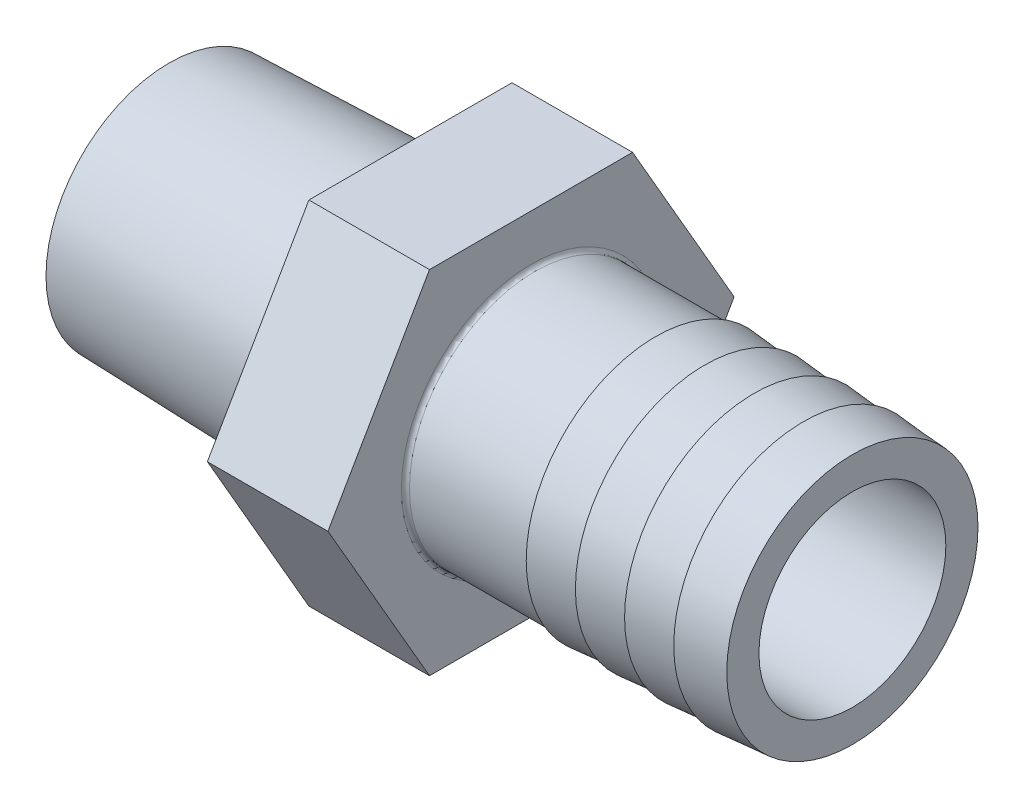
ISO-10303-21;
HEADER;
FILE_DESCRIPTION(('STEP AP214'),'2;1');
FILE_NAME('part.step','',(''),(''),'','','');
FILE_SCHEMA(('AUTOMOTIVE_DESIGN { 1 0 10303 214 1 1 1 1 }'));
ENDSEC;
DATA;
#1=APPLICATION_CONTEXT('core data for automotive mechanical design processes');
#2=APPLICATION_PROTOCOL_DEFINITION('international standard','automotive_design',2000,#1);
#3=PRODUCT_CONTEXT('',#1,'mechanical');
#4=PRODUCT('Part','Part','',(#3));
#5=PRODUCT_RELATED_PRODUCT_CATEGORY('part','',(#4));
#6=PRODUCT_DEFINITION_FORMATION('','',#4);
#7=PRODUCT_DEFINITION_CONTEXT('part definition',#1,'design');
#8=PRODUCT_DEFINITION('design','',#6,#7);
#9=PRODUCT_DEFINITION_SHAPE('','',#8);
#10=(LENGTH_UNIT() NAMED_UNIT(*) SI_UNIT(.MILLI.,.METRE.));
#11=(NAMED_UNIT(*) PLANE_ANGLE_UNIT() SI_UNIT($,.RADIAN.));
#12=(NAMED_UNIT(*) SI_UNIT($,.STERADIAN.) SOLID_ANGLE_UNIT());
#13=UNCERTAINTY_MEASURE_WITH_UNIT(LENGTH_MEASURE(1.E-05),#10,'distance_accuracy_value','');
#14=(GEOMETRIC_REPRESENTATION_CONTEXT(3) GLOBAL_UNCERTAINTY_ASSIGNED_CONTEXT((#13)) GLOBAL_UNIT_ASSIGNED_CONTEXT((#10,
#11,#12)) REPRESENTATION_CONTEXT('',''));
#15=CARTESIAN_POINT('',(0.,0.,0.));
#16=DIRECTION('',(0.,0.,1.));
#17=DIRECTION('',(1.,0.,0.));
#18=AXIS2_PLACEMENT_3D('',#15,#16,#17);
#19=CARTESIAN_POINT('',(-50.7999999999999,0.,0.));
#20=DIRECTION('',(-1.,0.,0.));
#21=DIRECTION('',(0.,0.,1.));
#22=AXIS2_PLACEMENT_3D('',#19,#20,#21);
#23=CYLINDRICAL_SURFACE('',#22,5.9055);
#24=CARTESIAN_POINT('',(27.92476,0.,0.));
#25=DIRECTION('',(-1.,0.,0.));
#26=DIRECTION('',(0.,0.,1.));
#27=AXIS2_PLACEMENT_3D('',#24,#25,#26);
#28=CIRCLE('',#27,5.9055);
#29=CARTESIAN_POINT('',(27.92476,0.,5.9055));
#30=VERTEX_POINT('',#29);
#31=EDGE_CURVE('E144',#30,#30,#28,.T.);
#32=ORIENTED_EDGE('',*,*,#31,.F.);
#33=EDGE_LOOP('',(#32));
#34=FACE_BOUND('',#33,.T.);
#35=CARTESIAN_POINT('',(7.62,0.,0.));
#36=DIRECTION('',(-1.,0.,0.));
#37=DIRECTION('',(0.,0.,1.));
#38=AXIS2_PLACEMENT_3D('',#35,#36,#37);
#39=CIRCLE('',#38,5.9055);
#40=CARTESIAN_POINT('',(7.62,0.,5.9055));
#41=VERTEX_POINT('',#40);
#42=EDGE_CURVE('E11',#41,#41,#39,.F.);
#43=ORIENTED_EDGE('',*,*,#42,.F.);
#44=EDGE_LOOP('',(#43));
#45=FACE_BOUND('',#44,.T.);
#46=ADVANCED_FACE('F35',(#34,#45),#23,.F.);
#47=CARTESIAN_POINT('',(7.62,8.24930684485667,0.));
#48=DIRECTION('',(-1.,0.,0.));
#49=DIRECTION('',(0.,0.,1.));
#50=AXIS2_PLACEMENT_3D('',#47,#48,#49);
#51=PLANE('',#50);
#52=CARTESIAN_POINT('',(7.62,0.,0.));
#53=DIRECTION('',(-1.,0.,0.));
#54=DIRECTION('',(0.,0.,1.));
#55=AXIS2_PLACEMENT_3D('',#52,#53,#54);
#56=CIRCLE('',#55,8.1915);
#57=CARTESIAN_POINT('',(7.62,0.,8.1915));
#58=VERTEX_POINT('',#57);
#59=EDGE_CURVE('E138',#58,#58,#56,.T.);
#60=ORIENTED_EDGE('',*,*,#59,.T.);
#61=EDGE_LOOP('',(#60));
#62=FACE_BOUND('',#61,.T.);
#63=DIRECTION('',(0.,0.866025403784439,-0.5));
#64=VECTOR('',#63,1.);
#65=CARTESIAN_POINT('',(7.62,-11.1125,-6.41580486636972));
#66=LINE('',#65,#64);
#67=CARTESIAN_POINT('',(7.62,-11.1125,-6.41580486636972));
#68=VERTEX_POINT('',#67);
#69=CARTESIAN_POINT('',(7.62,0.,-12.8316097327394));
#70=VERTEX_POINT('',#69);
#71=EDGE_CURVE('E89',#68,#70,#66,.T.);
#72=ORIENTED_EDGE('',*,*,#71,.T.);
#73=DIRECTION('',(0.,0.866025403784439,0.5));
#74=VECTOR('',#73,1.);
#75=CARTESIAN_POINT('',(7.62,0.,-12.8316097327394));
#76=LINE('',#75,#74);
#77=CARTESIAN_POINT('',(7.62,11.1125,-6.41580486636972));
#78=VERTEX_POINT('',#77);
#79=EDGE_CURVE('E99',#70,#78,#76,.T.);
#80=ORIENTED_EDGE('',*,*,#79,.T.);
#81=DIRECTION('',(0.,0.,1.));
#82=VECTOR('',#81,1.);
#83=CARTESIAN_POINT('',(7.62,11.1125,-6.41580486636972));
#84=LINE('',#83,#82);
#85=CARTESIAN_POINT('',(7.62,11.1125,6.41580486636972));
#86=VERTEX_POINT('',#85);
#87=EDGE_CURVE('E105',#78,#86,#84,.T.);
#88=ORIENTED_EDGE('',*,*,#87,.T.);
#89=DIRECTION('',(0.,-0.866025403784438,0.5));
#90=VECTOR('',#89,1.);
#91=CARTESIAN_POINT('',(7.62,11.1125,6.41580486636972));
#92=LINE('',#91,#90);
#93=CARTESIAN_POINT('',(7.62,0.,12.8316097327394));
#94=VERTEX_POINT('',#93);
#95=EDGE_CURVE('E114',#86,#94,#92,.T.);
#96=ORIENTED_EDGE('',*,*,#95,.T.);
#97=DIRECTION('',(0.,-0.866025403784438,-0.5));
#98=VECTOR('',#97,1.);
#99=CARTESIAN_POINT('',(7.62,0.,12.8316097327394));
#100=LINE('',#99,#98);
#101=CARTESIAN_POINT('',(7.62,-11.1125,6.41580486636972));
#102=VERTEX_POINT('',#101);
#103=EDGE_CURVE('E117',#94,#102,#100,.T.);
#104=ORIENTED_EDGE('',*,*,#103,.T.);
#105=DIRECTION('',(0.,0.,-1.));
#106=VECTOR('',#105,1.);
#107=CARTESIAN_POINT('',(7.62,-11.1125,6.41580486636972));
#108=LINE('',#107,#106);
#109=EDGE_CURVE('E96',#102,#68,#108,.T.);
#110=ORIENTED_EDGE('',*,*,#109,.T.);
#111=EDGE_LOOP('',(#72,#80,#88,#96,#104,#110));
#112=FACE_BOUND('',#111,.T.);
#113=ADVANCED_FACE('F37',(#62,#112),#51,.F.);
#114=CARTESIAN_POINT('',(7.874,0.,0.));
#115=DIRECTION('',(-1.,0.,0.));
#116=DIRECTION('',(0.,0.,1.));
#117=AXIS2_PLACEMENT_3D('',#114,#115,#116);
#118=TOROIDAL_SURFACE('',#117,8.1915,0.253999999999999);
#119=ORIENTED_EDGE('',*,*,#59,.F.);
#120=EDGE_LOOP('',(#119));
#121=FACE_BOUND('',#120,.T.);
#122=CARTESIAN_POINT('',(7.874,0.,0.));
#123=DIRECTION('',(-1.,0.,0.));
#124=DIRECTION('',(0.,0.,1.));
#125=AXIS2_PLACEMENT_3D('',#122,#123,#124);
#126=CIRCLE('',#125,7.9375);
#127=CARTESIAN_POINT('',(7.874,0.,7.9375));
#128=VERTEX_POINT('',#127);
#129=EDGE_CURVE('E174',#128,#128,#126,.T.);
#130=ORIENTED_EDGE('',*,*,#129,.T.);
#131=EDGE_LOOP('',(#130));
#132=FACE_BOUND('',#131,.T.);
#133=ADVANCED_FACE('F180',(#121,#132),#118,.F.);
#134=CARTESIAN_POINT('',(-50.7999999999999,0.,0.));
#135=DIRECTION('',(-1.,0.,0.));
#136=DIRECTION('',(0.,0.,1.));
#137=AXIS2_PLACEMENT_3D('',#134,#135,#136);
#138=CYLINDRICAL_SURFACE('',#137,7.9375);
#139=ORIENTED_EDGE('',*,*,#129,.F.);
#140=EDGE_LOOP('',(#139));
#141=FACE_BOUND('',#140,.T.);
#142=CARTESIAN_POINT('',(15.494,0.,0.));
#143=DIRECTION('',(-1.,0.,0.));
#144=DIRECTION('',(0.,0.,1.));
#145=AXIS2_PLACEMENT_3D('',#142,#143,#144);
#146=CIRCLE('',#145,7.9375);
#147=CARTESIAN_POINT('',(15.494,0.,7.9375));
#148=VERTEX_POINT('',#147);
#149=EDGE_CURVE('E171',#148,#148,#146,.T.);
#150=ORIENTED_EDGE('',*,*,#149,.T.);
#151=EDGE_LOOP('',(#150));
#152=FACE_BOUND('',#151,.T.);
#153=ADVANCED_FACE('F183',(#141,#152),#138,.T.);
#154=CARTESIAN_POINT('',(15.494,7.9375,0.));
#155=DIRECTION('',(1.,0.,0.));
#156=DIRECTION('',(0.,0.,-1.));
#157=AXIS2_PLACEMENT_3D('',#154,#155,#156);
#158=PLANE('',#157);
#159=ORIENTED_EDGE('',*,*,#149,.F.);
#160=EDGE_LOOP('',(#159));
#161=FACE_BOUND('',#160,.T.);
#162=CARTESIAN_POINT('',(15.494,0.,0.));
#163=DIRECTION('',(-1.,0.,0.));
#164=DIRECTION('',(0.,0.,1.));
#165=AXIS2_PLACEMENT_3D('',#162,#163,#164);
#166=CIRCLE('',#165,8.1788);
#167=CARTESIAN_POINT('',(15.494,0.,8.1788));
#168=VERTEX_POINT('',#167);
#169=EDGE_CURVE('E168',#168,#168,#166,.T.);
#170=ORIENTED_EDGE('',*,*,#169,.T.);
#171=EDGE_LOOP('',(#170));
#172=FACE_BOUND('',#171,.T.);
#173=ADVANCED_FACE('F188',(#161,#172),#158,.F.);
#174=CARTESIAN_POINT('',(18.60169,0.,0.));
#175=DIRECTION('',(-1.,0.,0.));
#176=DIRECTION('',(0.,0.,1.));
#177=AXIS2_PLACEMENT_3D('',#174,#175,#176);
#178=CONICAL_SURFACE('',#177,7.9375,0.0774906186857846);
#179=ORIENTED_EDGE('',*,*,#169,.F.);
#180=EDGE_LOOP('',(#179));
#181=FACE_BOUND('',#180,.T.);
#182=CARTESIAN_POINT('',(18.60169,0.,0.));
#183=DIRECTION('',(-1.,0.,0.));
#184=DIRECTION('',(0.,0.,1.));
#185=AXIS2_PLACEMENT_3D('',#182,#183,#184);
#186=CIRCLE('',#185,7.9375);
#187=CARTESIAN_POINT('',(18.60169,0.,7.9375));
#188=VERTEX_POINT('',#187);
#189=EDGE_CURVE('E165',#188,#188,#186,.T.);
#190=ORIENTED_EDGE('',*,*,#189,.T.);
#191=EDGE_LOOP('',(#190));
#192=FACE_BOUND('',#191,.T.);
#193=ADVANCED_FACE('F194',(#181,#192),#178,.T.);
#194=CARTESIAN_POINT('',(18.60169,7.9375,0.));
#195=DIRECTION('',(1.,0.,0.));
#196=DIRECTION('',(0.,0.,-1.));
#197=AXIS2_PLACEMENT_3D('',#194,#195,#196);
#198=PLANE('',#197);
#199=ORIENTED_EDGE('',*,*,#189,.F.);
#200=EDGE_LOOP('',(#199));
#201=FACE_BOUND('',#200,.T.);
#202=CARTESIAN_POINT('',(18.60169,0.,0.));
#203=DIRECTION('',(-1.,0.,0.));
#204=DIRECTION('',(0.,0.,1.));
#205=AXIS2_PLACEMENT_3D('',#202,#203,#204);
#206=CIRCLE('',#205,8.1788);
#207=CARTESIAN_POINT('',(18.60169,0.,8.1788));
#208=VERTEX_POINT('',#207);
#209=EDGE_CURVE('E162',#208,#208,#206,.T.);
#210=ORIENTED_EDGE('',*,*,#209,.T.);
#211=EDGE_LOOP('',(#210));
#212=FACE_BOUND('',#211,.T.);
#213=ADVANCED_FACE('F200',(#201,#212),#198,.F.);
#214=CARTESIAN_POINT('',(21.70938,0.,0.));
#215=DIRECTION('',(-1.,0.,0.));
#216=DIRECTION('',(0.,0.,1.));
#217=AXIS2_PLACEMENT_3D('',#214,#215,#216);
#218=CONICAL_SURFACE('',#217,7.9375,0.0774906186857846);
#219=ORIENTED_EDGE('',*,*,#209,.F.);
#220=EDGE_LOOP('',(#219));
#221=FACE_BOUND('',#220,.T.);
#222=CARTESIAN_POINT('',(21.70938,0.,0.));
#223=DIRECTION('',(-1.,0.,0.));
#224=DIRECTION('',(0.,0.,1.));
#225=AXIS2_PLACEMENT_3D('',#222,#223,#224);
#226=CIRCLE('',#225,7.9375);
#227=CARTESIAN_POINT('',(21.70938,0.,7.9375));
#228=VERTEX_POINT('',#227);
#229=EDGE_CURVE('E159',#228,#228,#226,.T.);
#230=ORIENTED_EDGE('',*,*,#229,.T.);
#231=EDGE_LOOP('',(#230));
#232=FACE_BOUND('',#231,.T.);
#233=ADVANCED_FACE('F206',(#221,#232),#218,.T.);
#234=CARTESIAN_POINT('',(21.70938,7.9375,0.));
#235=DIRECTION('',(1.,0.,0.));
#236=DIRECTION('',(0.,0.,-1.));
#237=AXIS2_PLACEMENT_3D('',#234,#235,#236);
#238=PLANE('',#237);
#239=ORIENTED_EDGE('',*,*,#229,.F.);
#240=EDGE_LOOP('',(#239));
#241=FACE_BOUND('',#240,.T.);
#242=CARTESIAN_POINT('',(21.70938,0.,0.));
#243=DIRECTION('',(-1.,0.,0.));
#244=DIRECTION('',(0.,0.,1.));
#245=AXIS2_PLACEMENT_3D('',#242,#243,#244);
#246=CIRCLE('',#245,8.1788);
#247=CARTESIAN_POINT('',(21.70938,0.,8.1788));
#248=VERTEX_POINT('',#247);
#249=EDGE_CURVE('E156',#248,#248,#246,.T.);
#250=ORIENTED_EDGE('',*,*,#249,.T.);
#251=EDGE_LOOP('',(#250));
#252=FACE_BOUND('',#251,.T.);
#253=ADVANCED_FACE('F212',(#241,#252),#238,.F.);
#254=CARTESIAN_POINT('',(24.81707,0.,0.));
#255=DIRECTION('',(-1.,0.,0.));
#256=DIRECTION('',(0.,0.,1.));
#257=AXIS2_PLACEMENT_3D('',#254,#255,#256);
#258=CONICAL_SURFACE('',#257,7.9375,0.077490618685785);
#259=ORIENTED_EDGE('',*,*,#249,.F.);
#260=EDGE_LOOP('',(#259));
#261=FACE_BOUND('',#260,.T.);
#262=CARTESIAN_POINT('',(24.81707,0.,0.));
#263=DIRECTION('',(-1.,0.,0.));
#264=DIRECTION('',(0.,0.,1.));
#265=AXIS2_PLACEMENT_3D('',#262,#263,#264);
#266=CIRCLE('',#265,7.9375);
#267=CARTESIAN_POINT('',(24.81707,0.,7.9375));
#268=VERTEX_POINT('',#267);
#269=EDGE_CURVE('E153',#268,#268,#266,.T.);
#270=ORIENTED_EDGE('',*,*,#269,.T.);
#271=EDGE_LOOP('',(#270));
#272=FACE_BOUND('',#271,.T.);
#273=ADVANCED_FACE('F218',(#261,#272),#258,.T.);
#274=CARTESIAN_POINT('',(24.81707,7.9375,0.));
#275=DIRECTION('',(1.,0.,0.));
#276=DIRECTION('',(0.,0.,-1.));
#277=AXIS2_PLACEMENT_3D('',#274,#275,#276);
#278=PLANE('',#277);
#279=ORIENTED_EDGE('',*,*,#269,.F.);
#280=EDGE_LOOP('',(#279));
#281=FACE_BOUND('',#280,.T.);
#282=CARTESIAN_POINT('',(24.81707,0.,0.));
#283=DIRECTION('',(-1.,0.,0.));
#284=DIRECTION('',(0.,0.,1.));
#285=AXIS2_PLACEMENT_3D('',#282,#283,#284);
#286=CIRCLE('',#285,8.1788);
#287=CARTESIAN_POINT('',(24.81707,0.,8.1788));
#288=VERTEX_POINT('',#287);
#289=EDGE_CURVE('E150',#288,#288,#286,.T.);
#290=ORIENTED_EDGE('',*,*,#289,.T.);
#291=EDGE_LOOP('',(#290));
#292=FACE_BOUND('',#291,.T.);
#293=ADVANCED_FACE('F224',(#281,#292),#278,.F.);
#294=CARTESIAN_POINT('',(27.92476,0.,0.));
#295=DIRECTION('',(-1.,0.,0.));
#296=DIRECTION('',(0.,0.,1.));
#297=AXIS2_PLACEMENT_3D('',#294,#295,#296);
#298=CONICAL_SURFACE('',#297,7.9375,0.077490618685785);
#299=ORIENTED_EDGE('',*,*,#289,.F.);
#300=EDGE_LOOP('',(#299));
#301=FACE_BOUND('',#300,.T.);
#302=CARTESIAN_POINT('',(27.92476,0.,0.));
#303=DIRECTION('',(-1.,0.,0.));
#304=DIRECTION('',(0.,0.,1.));
#305=AXIS2_PLACEMENT_3D('',#302,#303,#304);
#306=CIRCLE('',#305,7.9375);
#307=CARTESIAN_POINT('',(27.92476,0.,7.9375));
#308=VERTEX_POINT('',#307);
#309=EDGE_CURVE('E147',#308,#308,#306,.T.);
#310=ORIENTED_EDGE('',*,*,#309,.T.);
#311=EDGE_LOOP('',(#310));
#312=FACE_BOUND('',#311,.T.);
#313=ADVANCED_FACE('F230',(#301,#312),#298,.T.);
#314=CARTESIAN_POINT('',(27.92476,5.9055,0.));
#315=DIRECTION('',(-1.,0.,0.));
#316=DIRECTION('',(0.,0.,1.));
#317=AXIS2_PLACEMENT_3D('',#314,#315,#316);
#318=PLANE('',#317);
#319=ORIENTED_EDGE('',*,*,#309,.F.);
#320=EDGE_LOOP('',(#319));
#321=FACE_BOUND('',#320,.T.);
#322=ORIENTED_EDGE('',*,*,#31,.T.);
#323=EDGE_LOOP('',(#322));
#324=FACE_BOUND('',#323,.T.);
#325=ADVANCED_FACE('F236',(#321,#324),#318,.F.);
#326=CARTESIAN_POINT('',(0.,0.,0.));
#327=DIRECTION('',(1.,0.,0.));
#328=DIRECTION('',(0.,0.,-1.));
#329=AXIS2_PLACEMENT_3D('',#326,#327,#328);
#330=PLANE('',#329);
#331=CARTESIAN_POINT('',(0.,0.,0.));
#332=DIRECTION('',(1.,0.,0.));
#333=DIRECTION('',(0.,0.,-1.));
#334=AXIS2_PLACEMENT_3D('',#331,#332,#333);
#335=CIRCLE('',#334,8.24930684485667);
#336=CARTESIAN_POINT('',(0.,0.,-8.24930684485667));
#337=VERTEX_POINT('',#336);
#338=EDGE_CURVE('E132',#337,#337,#335,.T.);
#339=ORIENTED_EDGE('',*,*,#338,.T.);
#340=EDGE_LOOP('',(#339));
#341=FACE_BOUND('',#340,.T.);
#342=DIRECTION('',(0.,-0.866025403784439,0.5));
#343=VECTOR('',#342,1.);
#344=CARTESIAN_POINT('',(0.,-11.1125,-6.41580486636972));
#345=LINE('',#344,#343);
#346=CARTESIAN_POINT('',(0.,0.,-12.8316097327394));
#347=VERTEX_POINT('',#346);
#348=CARTESIAN_POINT('',(0.,-11.1125,-6.41580486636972));
#349=VERTEX_POINT('',#348);
#350=EDGE_CURVE('E92',#347,#349,#345,.T.);
#351=ORIENTED_EDGE('',*,*,#350,.T.);
#352=DIRECTION('',(0.,0.,1.));
#353=VECTOR('',#352,1.);
#354=CARTESIAN_POINT('',(0.,-11.1125,6.41580486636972));
#355=LINE('',#354,#353);
#356=CARTESIAN_POINT('',(0.,-11.1125,6.41580486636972));
#357=VERTEX_POINT('',#356);
#358=EDGE_CURVE('E299',#349,#357,#355,.T.);
#359=ORIENTED_EDGE('',*,*,#358,.T.);
#360=DIRECTION('',(0.,0.866025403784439,0.5));
#361=VECTOR('',#360,1.);
#362=CARTESIAN_POINT('',(0.,0.,12.8316097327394));
#363=LINE('',#362,#361);
#364=CARTESIAN_POINT('',(0.,0.,12.8316097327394));
#365=VERTEX_POINT('',#364);
#366=EDGE_CURVE('E302',#357,#365,#363,.T.);
#367=ORIENTED_EDGE('',*,*,#366,.T.);
#368=DIRECTION('',(0.,0.866025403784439,-0.5));
#369=VECTOR('',#368,1.);
#370=CARTESIAN_POINT('',(0.,11.1125,6.41580486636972));
#371=LINE('',#370,#369);
#372=CARTESIAN_POINT('',(0.,11.1125,6.41580486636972));
#373=VERTEX_POINT('',#372);
#374=EDGE_CURVE('E51',#365,#373,#371,.T.);
#375=ORIENTED_EDGE('',*,*,#374,.T.);
#376=DIRECTION('',(0.,0.,-1.));
#377=VECTOR('',#376,1.);
#378=CARTESIAN_POINT('',(0.,11.1125,-6.41580486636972));
#379=LINE('',#378,#377);
#380=CARTESIAN_POINT('',(0.,11.1125,-6.41580486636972));
#381=VERTEX_POINT('',#380);
#382=EDGE_CURVE('E122',#373,#381,#379,.T.);
#383=ORIENTED_EDGE('',*,*,#382,.T.);
#384=DIRECTION('',(0.,-0.866025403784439,-0.5));
#385=VECTOR('',#384,1.);
#386=CARTESIAN_POINT('',(0.,0.,-12.8316097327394));
#387=LINE('',#386,#385);
#388=EDGE_CURVE('E130',#381,#347,#387,.T.);
#389=ORIENTED_EDGE('',*,*,#388,.T.);
#390=EDGE_LOOP('',(#351,#359,#367,#375,#383,#389));
#391=FACE_BOUND('',#390,.T.);
#392=ADVANCED_FACE('F242',(#341,#391),#330,.F.);
#393=CARTESIAN_POINT('',(-33.9492482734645,0.,-12.8316097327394));
#394=DIRECTION('',(0.,0.5,-0.866025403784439));
#395=DIRECTION('',(0.,0.866025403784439,0.5));
#396=AXIS2_PLACEMENT_3D('',#393,#394,#395);
#397=PLANE('',#396);
#398=ORIENTED_EDGE('',*,*,#388,.F.);
#399=DIRECTION('',(1.,0.,0.));
#400=VECTOR('',#399,1.);
#401=CARTESIAN_POINT('',(-33.9492482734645,11.1125,-6.41580486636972));
#402=LINE('',#401,#400);
#403=EDGE_CURVE('E95',#381,#78,#402,.T.);
#404=ORIENTED_EDGE('',*,*,#403,.T.);
#405=ORIENTED_EDGE('',*,*,#79,.F.);
#406=DIRECTION('',(1.,0.,0.));
#407=VECTOR('',#406,1.);
#408=CARTESIAN_POINT('',(-33.9492482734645,0.,-12.8316097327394));
#409=LINE('',#408,#407);
#410=EDGE_CURVE('E84',#347,#70,#409,.T.);
#411=ORIENTED_EDGE('',*,*,#410,.F.);
#412=EDGE_LOOP('',(#398,#404,#405,#411));
#413=FACE_BOUND('',#412,.T.);
#414=ADVANCED_FACE('F100',(#413),#397,.T.);
#415=CARTESIAN_POINT('',(-33.9492482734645,11.1125,-6.41580486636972));
#416=DIRECTION('',(0.,1.,0.));
#417=DIRECTION('',(0.,0.,1.));
#418=AXIS2_PLACEMENT_3D('',#415,#416,#417);
#419=PLANE('',#418);
#420=ORIENTED_EDGE('',*,*,#382,.F.);
#421=DIRECTION('',(1.,0.,0.));
#422=VECTOR('',#421,1.);
#423=CARTESIAN_POINT('',(-33.9492482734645,11.1125,6.41580486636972));
#424=LINE('',#423,#422);
#425=EDGE_CURVE('E127',#373,#86,#424,.T.);
#426=ORIENTED_EDGE('',*,*,#425,.T.);
#427=ORIENTED_EDGE('',*,*,#87,.F.);
#428=ORIENTED_EDGE('',*,*,#403,.F.);
#429=EDGE_LOOP('',(#420,#426,#427,#428));
#430=FACE_BOUND('',#429,.T.);
#431=ADVANCED_FACE('F275',(#430),#419,.T.);
#432=CARTESIAN_POINT('',(-33.9492482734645,11.1125,6.41580486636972));
#433=DIRECTION('',(0.,0.5,0.866025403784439));
#434=DIRECTION('',(0.,-0.866025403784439,0.5));
#435=AXIS2_PLACEMENT_3D('',#432,#433,#434);
#436=PLANE('',#435);
#437=ORIENTED_EDGE('',*,*,#374,.F.);
#438=DIRECTION('',(1.,0.,0.));
#439=VECTOR('',#438,1.);
#440=CARTESIAN_POINT('',(-33.9492482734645,0.,12.8316097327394));
#441=LINE('',#440,#439);
#442=EDGE_CURVE('E125',#365,#94,#441,.T.);
#443=ORIENTED_EDGE('',*,*,#442,.T.);
#444=ORIENTED_EDGE('',*,*,#95,.F.);
#445=ORIENTED_EDGE('',*,*,#425,.F.);
#446=EDGE_LOOP('',(#437,#443,#444,#445));
#447=FACE_BOUND('',#446,.T.);
#448=ADVANCED_FACE('F271',(#447),#436,.T.);
#449=CARTESIAN_POINT('',(-33.9492482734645,0.,12.8316097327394));
#450=DIRECTION('',(0.,-0.5,0.866025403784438));
#451=DIRECTION('',(0.,-0.866025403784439,-0.5));
#452=AXIS2_PLACEMENT_3D('',#449,#450,#451);
#453=PLANE('',#452);
#454=ORIENTED_EDGE('',*,*,#366,.F.);
#455=DIRECTION('',(1.,0.,0.));
#456=VECTOR('',#455,1.);
#457=CARTESIAN_POINT('',(-33.9492482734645,-11.1125,6.41580486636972));
#458=LINE('',#457,#456);
#459=EDGE_CURVE('E123',#357,#102,#458,.T.);
#460=ORIENTED_EDGE('',*,*,#459,.T.);
#461=ORIENTED_EDGE('',*,*,#103,.F.);
#462=ORIENTED_EDGE('',*,*,#442,.F.);
#463=EDGE_LOOP('',(#454,#460,#461,#462));
#464=FACE_BOUND('',#463,.T.);
#465=ADVANCED_FACE('F267',(#464),#453,.T.);
#466=CARTESIAN_POINT('',(-33.9492482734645,-11.1125,6.41580486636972));
#467=DIRECTION('',(0.,-1.,0.));
#468=DIRECTION('',(0.,0.,-1.));
#469=AXIS2_PLACEMENT_3D('',#466,#467,#468);
#470=PLANE('',#469);
#471=ORIENTED_EDGE('',*,*,#358,.F.);
#472=DIRECTION('',(1.,0.,0.));
#473=VECTOR('',#472,1.);
#474=CARTESIAN_POINT('',(-33.9492482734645,-11.1125,-6.41580486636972));
#475=LINE('',#474,#473);
#476=EDGE_CURVE('E120',#349,#68,#475,.T.);
#477=ORIENTED_EDGE('',*,*,#476,.T.);
#478=ORIENTED_EDGE('',*,*,#109,.F.);
#479=ORIENTED_EDGE('',*,*,#459,.F.);
#480=EDGE_LOOP('',(#471,#477,#478,#479));
#481=FACE_BOUND('',#480,.T.);
#482=ADVANCED_FACE('F261',(#481),#470,.T.);
#483=CARTESIAN_POINT('',(-33.9492482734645,-11.1125,-6.41580486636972));
#484=DIRECTION('',(0.,-0.5,-0.866025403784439));
#485=DIRECTION('',(0.,0.866025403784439,-0.5));
#486=AXIS2_PLACEMENT_3D('',#483,#484,#485);
#487=PLANE('',#486);
#488=ORIENTED_EDGE('',*,*,#350,.F.);
#489=ORIENTED_EDGE('',*,*,#410,.T.);
#490=ORIENTED_EDGE('',*,*,#71,.F.);
#491=ORIENTED_EDGE('',*,*,#476,.F.);
#492=EDGE_LOOP('',(#488,#489,#490,#491));
#493=FACE_BOUND('',#492,.T.);
#494=ADVANCED_FACE('F86',(#493),#487,.T.);
#495=CARTESIAN_POINT('',(7.62,-22.225,0.));
#496=DIRECTION('',(-1.,0.,0.));
#497=DIRECTION('',(0.,0.,1.));
#498=AXIS2_PLACEMENT_3D('',#495,#496,#497);
#499=PLANE('',#498);
#500=ORIENTED_EDGE('',*,*,#42,.T.);
#501=EDGE_LOOP('',(#500));
#502=FACE_BOUND('',#501,.T.);
#503=ADVANCED_FACE('F252',(#502),#499,.F.);
#504=CARTESIAN_POINT('',(-15.25524,0.,0.));
#505=DIRECTION('',(-1.,0.,0.));
#506=DIRECTION('',(0.,0.,1.));
#507=AXIS2_PLACEMENT_3D('',#504,#505,#506);
#508=CIRCLE('',#507,5.9055);
#509=CARTESIAN_POINT('',(-15.25524,0.,5.9055));
#510=VERTEX_POINT('',#509);
#511=EDGE_CURVE('E141',#510,#510,#508,.T.);
#512=ORIENTED_EDGE('',*,*,#511,.T.);
#513=EDGE_LOOP('',(#512));
#514=FACE_BOUND('',#513,.T.);
#515=CARTESIAN_POINT('',(0.,0.,0.));
#516=DIRECTION('',(1.,0.,0.));
#517=DIRECTION('',(0.,0.,-1.));
#518=AXIS2_PLACEMENT_3D('',#515,#516,#517);
#519=CIRCLE('',#518,5.9055);
#520=CARTESIAN_POINT('',(0.,0.,-5.9055));
#521=VERTEX_POINT('',#520);
#522=EDGE_CURVE('E44',#521,#521,#519,.F.);
#523=ORIENTED_EDGE('',*,*,#522,.F.);
#524=EDGE_LOOP('',(#523));
#525=FACE_BOUND('',#524,.T.);
#526=ADVANCED_FACE('F249',(#514,#525),#23,.F.);
#527=CARTESIAN_POINT('',(-15.25524,7.772527,0.));
#528=DIRECTION('',(1.,0.,0.));
#529=DIRECTION('',(0.,0.,-1.));
#530=AXIS2_PLACEMENT_3D('',#527,#528,#529);
#531=PLANE('',#530);
#532=ORIENTED_EDGE('',*,*,#511,.F.);
#533=EDGE_LOOP('',(#532));
#534=FACE_BOUND('',#533,.T.);
#535=CARTESIAN_POINT('',(-15.25524,0.,0.));
#536=DIRECTION('',(-1.,0.,0.));
#537=DIRECTION('',(0.,0.,1.));
#538=AXIS2_PLACEMENT_3D('',#535,#536,#537);
#539=CIRCLE('',#538,7.772527);
#540=CARTESIAN_POINT('',(-15.25524,0.,7.772527));
#541=VERTEX_POINT('',#540);
#542=EDGE_CURVE('E135',#541,#541,#539,.T.);
#543=ORIENTED_EDGE('',*,*,#542,.T.);
#544=EDGE_LOOP('',(#543));
#545=FACE_BOUND('',#544,.T.);
#546=ADVANCED_FACE('F259',(#534,#545),#531,.F.);
#547=CARTESIAN_POINT('',(0.,0.,0.));
#548=DIRECTION('',(1.,0.,0.));
#549=DIRECTION('',(0.,0.,-1.));
#550=AXIS2_PLACEMENT_3D('',#547,#548,#549);
#551=CONICAL_SURFACE('',#550,8.24930684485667,0.0312433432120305);
#552=ORIENTED_EDGE('',*,*,#542,.F.);
#553=EDGE_LOOP('',(#552));
#554=FACE_BOUND('',#553,.T.);
#555=ORIENTED_EDGE('',*,*,#338,.F.);
#556=EDGE_LOOP('',(#555));
#557=FACE_BOUND('',#556,.T.);
#558=ADVANCED_FACE('F282',(#554,#557),#551,.T.);
#559=ORIENTED_EDGE('',*,*,#522,.T.);
#560=EDGE_LOOP('',(#559));
#561=FACE_BOUND('',#560,.T.);
#562=ADVANCED_FACE('F285',(#561),#330,.F.);
#563=CLOSED_SHELL('',(#46,#113,#133,#153,#173,#193,#213,#233,#253,#273,#293,#313,#325,#392,#414,
#431,#448,#465,#482,#494,#503,#526,#546,#558,#562));
#564=MANIFOLD_SOLID_BREP('B2',#563);
#565=ADVANCED_BREP_SHAPE_REPRESENTATION('',(#18,#564),#14);
#566=SHAPE_DEFINITION_REPRESENTATION(#9,#565);
ENDSEC;
END-ISO-10303-21;
